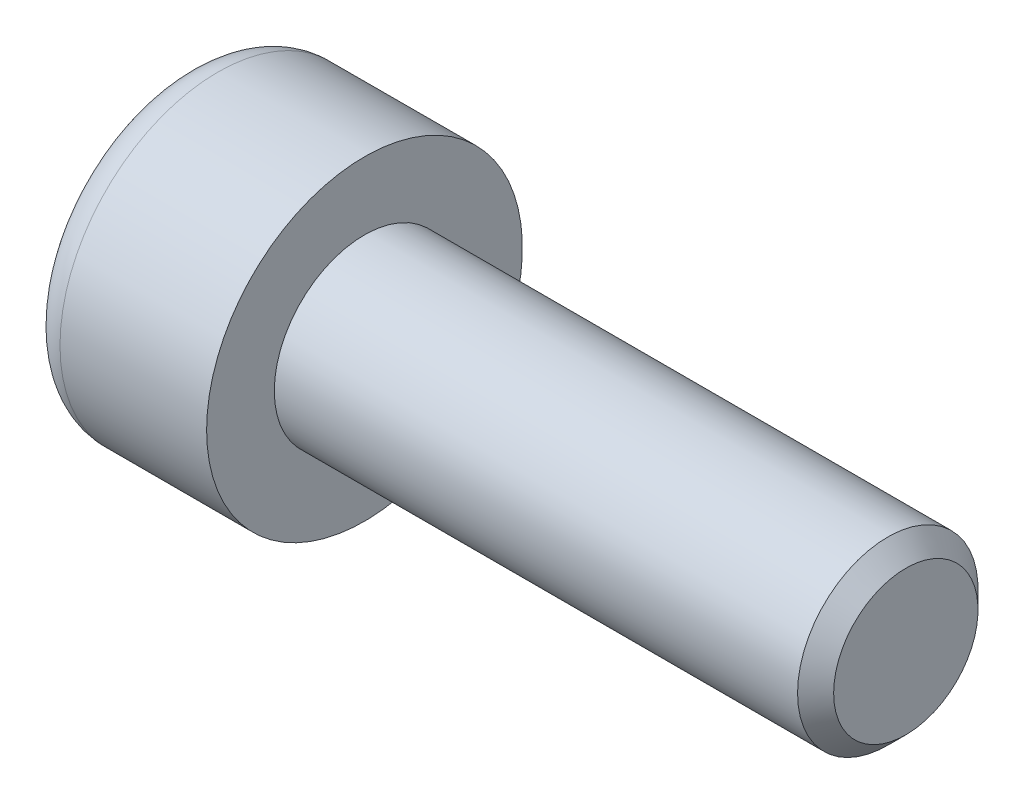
ISO-10303-21;
HEADER;
FILE_DESCRIPTION(('STEP AP214'),'2;1');
FILE_NAME('part.step','',(''),(''),'','','');
FILE_SCHEMA(('AUTOMOTIVE_DESIGN { 1 0 10303 214 1 1 1 1 }'));
ENDSEC;
DATA;
#1=APPLICATION_CONTEXT('core data for automotive mechanical design processes');
#2=APPLICATION_PROTOCOL_DEFINITION('international standard','automotive_design',2000,#1);
#3=PRODUCT_CONTEXT('',#1,'mechanical');
#4=PRODUCT('Part','Part','',(#3));
#5=PRODUCT_RELATED_PRODUCT_CATEGORY('part','',(#4));
#6=PRODUCT_DEFINITION_FORMATION('','',#4);
#7=PRODUCT_DEFINITION_CONTEXT('part definition',#1,'design');
#8=PRODUCT_DEFINITION('design','',#6,#7);
#9=PRODUCT_DEFINITION_SHAPE('','',#8);
#10=(LENGTH_UNIT() NAMED_UNIT(*) SI_UNIT(.MILLI.,.METRE.));
#11=(NAMED_UNIT(*) PLANE_ANGLE_UNIT() SI_UNIT($,.RADIAN.));
#12=(NAMED_UNIT(*) SI_UNIT($,.STERADIAN.) SOLID_ANGLE_UNIT());
#13=UNCERTAINTY_MEASURE_WITH_UNIT(LENGTH_MEASURE(1.E-05),#10,'distance_accuracy_value','');
#14=(GEOMETRIC_REPRESENTATION_CONTEXT(3) GLOBAL_UNCERTAINTY_ASSIGNED_CONTEXT((#13)) GLOBAL_UNIT_ASSIGNED_CONTEXT((#10,
#11,#12)) REPRESENTATION_CONTEXT('',''));
#15=CARTESIAN_POINT('',(0.,0.,0.));
#16=DIRECTION('',(0.,0.,1.));
#17=DIRECTION('',(1.,0.,0.));
#18=AXIS2_PLACEMENT_3D('',#15,#16,#17);
#19=CARTESIAN_POINT('',(12.,2.,0.));
#20=DIRECTION('',(-1.,0.,0.));
#21=DIRECTION('',(0.,0.,1.));
#22=AXIS2_PLACEMENT_3D('',#19,#20,#21);
#23=PLANE('',#22);
#24=CARTESIAN_POINT('',(12.,0.,0.));
#25=DIRECTION('',(-1.,0.,0.));
#26=DIRECTION('',(0.,0.,1.));
#27=AXIS2_PLACEMENT_3D('',#24,#25,#26);
#28=CIRCLE('',#27,1.59999999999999);
#29=CARTESIAN_POINT('',(12.,0.,1.59999999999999));
#30=VERTEX_POINT('',#29);
#31=EDGE_CURVE('E149',#30,#30,#28,.F.);
#32=ORIENTED_EDGE('',*,*,#31,.T.);
#33=EDGE_LOOP('',(#32));
#34=FACE_BOUND('',#33,.T.);
#35=ADVANCED_FACE('F32',(#34),#23,.F.);
#36=CARTESIAN_POINT('',(-28.9826848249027,0.,0.));
#37=DIRECTION('',(-1.,0.,0.));
#38=DIRECTION('',(0.,0.,1.));
#39=AXIS2_PLACEMENT_3D('',#36,#37,#38);
#40=CYLINDRICAL_SURFACE('',#39,2.);
#41=CARTESIAN_POINT('',(11.6,0.,0.));
#42=DIRECTION('',(-1.,0.,0.));
#43=DIRECTION('',(0.,0.,1.));
#44=AXIS2_PLACEMENT_3D('',#41,#42,#43);
#45=CIRCLE('',#44,2.);
#46=CARTESIAN_POINT('',(11.6,0.,2.));
#47=VERTEX_POINT('',#46);
#48=EDGE_CURVE('E146',#47,#47,#45,.T.);
#49=ORIENTED_EDGE('',*,*,#48,.T.);
#50=EDGE_LOOP('',(#49));
#51=FACE_BOUND('',#50,.T.);
#52=CARTESIAN_POINT('',(0.,0.,0.));
#53=DIRECTION('',(-1.,0.,0.));
#54=DIRECTION('',(0.,0.,1.));
#55=AXIS2_PLACEMENT_3D('',#52,#53,#54);
#56=CIRCLE('',#55,2.);
#57=CARTESIAN_POINT('',(0.,0.,2.));
#58=VERTEX_POINT('',#57);
#59=EDGE_CURVE('E143',#58,#58,#56,.T.);
#60=ORIENTED_EDGE('',*,*,#59,.F.);
#61=EDGE_LOOP('',(#60));
#62=FACE_BOUND('',#61,.T.);
#63=ADVANCED_FACE('F170',(#51,#62),#40,.T.);
#64=CARTESIAN_POINT('',(0.,3.5,0.));
#65=DIRECTION('',(-1.,0.,0.));
#66=DIRECTION('',(0.,0.,1.));
#67=AXIS2_PLACEMENT_3D('',#64,#65,#66);
#68=PLANE('',#67);
#69=CARTESIAN_POINT('',(0.,0.,0.));
#70=DIRECTION('',(-1.,0.,0.));
#71=DIRECTION('',(0.,0.,1.));
#72=AXIS2_PLACEMENT_3D('',#69,#70,#71);
#73=CIRCLE('',#72,3.5);
#74=CARTESIAN_POINT('',(0.,0.,3.5));
#75=VERTEX_POINT('',#74);
#76=EDGE_CURVE('E134',#75,#75,#73,.T.);
#77=ORIENTED_EDGE('',*,*,#76,.F.);
#78=EDGE_LOOP('',(#77));
#79=FACE_BOUND('',#78,.T.);
#80=ORIENTED_EDGE('',*,*,#59,.T.);
#81=EDGE_LOOP('',(#80));
#82=FACE_BOUND('',#81,.T.);
#83=ADVANCED_FACE('F175',(#79,#82),#68,.F.);
#84=CARTESIAN_POINT('',(-28.9826848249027,0.,0.));
#85=DIRECTION('',(-1.,0.,0.));
#86=DIRECTION('',(0.,0.,1.));
#87=AXIS2_PLACEMENT_3D('',#84,#85,#86);
#88=CYLINDRICAL_SURFACE('',#87,3.5);
#89=CARTESIAN_POINT('',(-3.25,0.,0.));
#90=DIRECTION('',(1.,0.,0.));
#91=DIRECTION('',(0.,0.,-1.));
#92=AXIS2_PLACEMENT_3D('',#89,#90,#91);
#93=CIRCLE('',#92,3.5);
#94=CARTESIAN_POINT('',(-3.25,0.,-3.5));
#95=VERTEX_POINT('',#94);
#96=EDGE_CURVE('E11',#95,#95,#93,.T.);
#97=ORIENTED_EDGE('',*,*,#96,.T.);
#98=EDGE_LOOP('',(#97));
#99=FACE_BOUND('',#98,.T.);
#100=ORIENTED_EDGE('',*,*,#76,.T.);
#101=EDGE_LOOP('',(#100));
#102=FACE_BOUND('',#101,.T.);
#103=ADVANCED_FACE('F184',(#99,#102),#88,.T.);
#104=CARTESIAN_POINT('',(-4.,0.,0.));
#105=DIRECTION('',(1.,0.,0.));
#106=DIRECTION('',(0.,0.,-1.));
#107=AXIS2_PLACEMENT_3D('',#104,#105,#106);
#108=PLANE('',#107);
#109=DIRECTION('',(0.,0.86602540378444,-0.499999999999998));
#110=VECTOR('',#109,1.);
#111=CARTESIAN_POINT('',(-4.,1.5,0.866025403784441));
#112=LINE('',#111,#110);
#113=CARTESIAN_POINT('',(-4.,0.,1.73205080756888));
#114=VERTEX_POINT('',#113);
#115=CARTESIAN_POINT('',(-4.,1.5,0.866025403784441));
#116=VERTEX_POINT('',#115);
#117=EDGE_CURVE('E100',#114,#116,#112,.T.);
#118=ORIENTED_EDGE('',*,*,#117,.F.);
#119=DIRECTION('',(0.,0.86602540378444,0.499999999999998));
#120=VECTOR('',#119,1.);
#121=CARTESIAN_POINT('',(-4.,0.,1.73205080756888));
#122=LINE('',#121,#120);
#123=CARTESIAN_POINT('',(-4.,-1.5,0.866025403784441));
#124=VERTEX_POINT('',#123);
#125=EDGE_CURVE('E46',#124,#114,#122,.T.);
#126=ORIENTED_EDGE('',*,*,#125,.F.);
#127=DIRECTION('',(0.,0.,1.));
#128=VECTOR('',#127,1.);
#129=CARTESIAN_POINT('',(-4.,-1.5,0.866025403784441));
#130=LINE('',#129,#128);
#131=CARTESIAN_POINT('',(-4.,-1.5,-0.86602540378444));
#132=VERTEX_POINT('',#131);
#133=EDGE_CURVE('E116',#132,#124,#130,.T.);
#134=ORIENTED_EDGE('',*,*,#133,.F.);
#135=DIRECTION('',(0.,-0.86602540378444,0.499999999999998));
#136=VECTOR('',#135,1.);
#137=CARTESIAN_POINT('',(-4.,-1.5,-0.86602540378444));
#138=LINE('',#137,#136);
#139=CARTESIAN_POINT('',(-4.,0.,-1.73205080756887));
#140=VERTEX_POINT('',#139);
#141=EDGE_CURVE('E110',#140,#132,#138,.T.);
#142=ORIENTED_EDGE('',*,*,#141,.F.);
#143=DIRECTION('',(0.,-0.86602540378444,-0.499999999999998));
#144=VECTOR('',#143,1.);
#145=CARTESIAN_POINT('',(-4.,0.,-1.73205080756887));
#146=LINE('',#145,#144);
#147=CARTESIAN_POINT('',(-4.,1.5,-0.866025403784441));
#148=VERTEX_POINT('',#147);
#149=EDGE_CURVE('E108',#148,#140,#146,.T.);
#150=ORIENTED_EDGE('',*,*,#149,.F.);
#151=DIRECTION('',(0.,0.,-1.));
#152=VECTOR('',#151,1.);
#153=CARTESIAN_POINT('',(-4.,1.5,-0.866025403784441));
#154=LINE('',#153,#152);
#155=EDGE_CURVE('E89',#116,#148,#154,.T.);
#156=ORIENTED_EDGE('',*,*,#155,.F.);
#157=EDGE_LOOP('',(#118,#126,#134,#142,#150,#156));
#158=FACE_BOUND('',#157,.T.);
#159=CARTESIAN_POINT('',(-4.,0.,0.));
#160=DIRECTION('',(1.,0.,0.));
#161=DIRECTION('',(0.,0.,-1.));
#162=AXIS2_PLACEMENT_3D('',#159,#160,#161);
#163=CIRCLE('',#162,2.75);
#164=CARTESIAN_POINT('',(-4.,0.,-2.75));
#165=VERTEX_POINT('',#164);
#166=EDGE_CURVE('E39',#165,#165,#163,.F.);
#167=ORIENTED_EDGE('',*,*,#166,.T.);
#168=EDGE_LOOP('',(#167));
#169=FACE_BOUND('',#168,.T.);
#170=ADVANCED_FACE('F104',(#158,#169),#108,.F.);
#171=CARTESIAN_POINT('',(11.6,0.,0.));
#172=DIRECTION('',(-1.,0.,0.));
#173=DIRECTION('',(0.,0.,1.));
#174=AXIS2_PLACEMENT_3D('',#171,#172,#173);
#175=CONICAL_SURFACE('',#174,2.,0.785398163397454);
#176=ORIENTED_EDGE('',*,*,#31,.F.);
#177=EDGE_LOOP('',(#176));
#178=FACE_BOUND('',#177,.T.);
#179=ORIENTED_EDGE('',*,*,#48,.F.);
#180=EDGE_LOOP('',(#179));
#181=FACE_BOUND('',#180,.T.);
#182=ADVANCED_FACE('F157',(#178,#181),#175,.T.);
#183=CARTESIAN_POINT('',(-3.25,0.,0.));
#184=DIRECTION('',(1.,0.,0.));
#185=DIRECTION('',(0.,0.,-1.));
#186=AXIS2_PLACEMENT_3D('',#183,#184,#185);
#187=TOROIDAL_SURFACE('',#186,2.75,0.75);
#188=ORIENTED_EDGE('',*,*,#96,.F.);
#189=EDGE_LOOP('',(#188));
#190=FACE_BOUND('',#189,.T.);
#191=ORIENTED_EDGE('',*,*,#166,.F.);
#192=EDGE_LOOP('',(#191));
#193=FACE_BOUND('',#192,.T.);
#194=ADVANCED_FACE('F154',(#190,#193),#187,.T.);
#195=CARTESIAN_POINT('',(-1.5,0.,1.73205080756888));
#196=DIRECTION('',(0.,-0.499999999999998,0.86602540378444));
#197=DIRECTION('',(0.,-0.86602540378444,-0.499999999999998));
#198=AXIS2_PLACEMENT_3D('',#195,#196,#197);
#199=PLANE('',#198);
#200=ORIENTED_EDGE('',*,*,#125,.T.);
#201=DIRECTION('',(-1.,0.,0.));
#202=VECTOR('',#201,1.);
#203=CARTESIAN_POINT('',(-1.5,0.,1.73205080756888));
#204=LINE('',#203,#202);
#205=CARTESIAN_POINT('',(-1.5,0.,1.73205080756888));
#206=VERTEX_POINT('',#205);
#207=EDGE_CURVE('E97',#206,#114,#204,.T.);
#208=ORIENTED_EDGE('',*,*,#207,.F.);
#209=DIRECTION('',(0.,0.86602540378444,0.499999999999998));
#210=VECTOR('',#209,1.);
#211=CARTESIAN_POINT('',(-1.5,0.,1.73205080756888));
#212=LINE('',#211,#210);
#213=CARTESIAN_POINT('',(-1.5,-1.5,0.866025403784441));
#214=VERTEX_POINT('',#213);
#215=EDGE_CURVE('E118',#214,#206,#212,.T.);
#216=ORIENTED_EDGE('',*,*,#215,.F.);
#217=DIRECTION('',(-1.,0.,0.));
#218=VECTOR('',#217,1.);
#219=CARTESIAN_POINT('',(-1.5,-1.5,0.866025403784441));
#220=LINE('',#219,#218);
#221=EDGE_CURVE('E53',#214,#124,#220,.T.);
#222=ORIENTED_EDGE('',*,*,#221,.T.);
#223=EDGE_LOOP('',(#200,#208,#216,#222));
#224=FACE_BOUND('',#223,.T.);
#225=ADVANCED_FACE('F156',(#224),#199,.F.);
#226=CARTESIAN_POINT('',(-1.5,-1.5,0.866025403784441));
#227=DIRECTION('',(0.,-1.,0.));
#228=DIRECTION('',(0.,0.,-1.));
#229=AXIS2_PLACEMENT_3D('',#226,#227,#228);
#230=PLANE('',#229);
#231=ORIENTED_EDGE('',*,*,#133,.T.);
#232=ORIENTED_EDGE('',*,*,#221,.F.);
#233=DIRECTION('',(0.,0.,1.));
#234=VECTOR('',#233,1.);
#235=CARTESIAN_POINT('',(-1.5,-1.5,0.866025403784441));
#236=LINE('',#235,#234);
#237=CARTESIAN_POINT('',(-1.5,-1.5,-0.86602540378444));
#238=VERTEX_POINT('',#237);
#239=EDGE_CURVE('E130',#238,#214,#236,.T.);
#240=ORIENTED_EDGE('',*,*,#239,.F.);
#241=DIRECTION('',(-1.,0.,0.));
#242=VECTOR('',#241,1.);
#243=CARTESIAN_POINT('',(-1.5,-1.5,-0.86602540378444));
#244=LINE('',#243,#242);
#245=EDGE_CURVE('E135',#238,#132,#244,.T.);
#246=ORIENTED_EDGE('',*,*,#245,.T.);
#247=EDGE_LOOP('',(#231,#232,#240,#246));
#248=FACE_BOUND('',#247,.T.);
#249=ADVANCED_FACE('F164',(#248),#230,.F.);
#250=CARTESIAN_POINT('',(-1.5,-1.5,-0.86602540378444));
#251=DIRECTION('',(0.,-0.499999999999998,-0.86602540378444));
#252=DIRECTION('',(0.,0.86602540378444,-0.499999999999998));
#253=AXIS2_PLACEMENT_3D('',#250,#251,#252);
#254=PLANE('',#253);
#255=ORIENTED_EDGE('',*,*,#141,.T.);
#256=ORIENTED_EDGE('',*,*,#245,.F.);
#257=DIRECTION('',(0.,-0.86602540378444,0.499999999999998));
#258=VECTOR('',#257,1.);
#259=CARTESIAN_POINT('',(-1.5,-1.5,-0.86602540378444));
#260=LINE('',#259,#258);
#261=CARTESIAN_POINT('',(-1.5,0.,-1.73205080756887));
#262=VERTEX_POINT('',#261);
#263=EDGE_CURVE('E127',#262,#238,#260,.T.);
#264=ORIENTED_EDGE('',*,*,#263,.F.);
#265=DIRECTION('',(-1.,0.,0.));
#266=VECTOR('',#265,1.);
#267=CARTESIAN_POINT('',(-1.5,0.,-1.73205080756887));
#268=LINE('',#267,#266);
#269=EDGE_CURVE('E137',#262,#140,#268,.T.);
#270=ORIENTED_EDGE('',*,*,#269,.T.);
#271=EDGE_LOOP('',(#255,#256,#264,#270));
#272=FACE_BOUND('',#271,.T.);
#273=ADVANCED_FACE('F230',(#272),#254,.F.);
#274=CARTESIAN_POINT('',(-1.5,0.,-1.73205080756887));
#275=DIRECTION('',(0.,0.499999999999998,-0.86602540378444));
#276=DIRECTION('',(0.,0.86602540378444,0.499999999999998));
#277=AXIS2_PLACEMENT_3D('',#274,#275,#276);
#278=PLANE('',#277);
#279=ORIENTED_EDGE('',*,*,#149,.T.);
#280=ORIENTED_EDGE('',*,*,#269,.F.);
#281=DIRECTION('',(0.,-0.86602540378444,-0.499999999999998));
#282=VECTOR('',#281,1.);
#283=CARTESIAN_POINT('',(-1.5,0.,-1.73205080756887));
#284=LINE('',#283,#282);
#285=CARTESIAN_POINT('',(-1.5,1.5,-0.866025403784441));
#286=VERTEX_POINT('',#285);
#287=EDGE_CURVE('E124',#286,#262,#284,.T.);
#288=ORIENTED_EDGE('',*,*,#287,.F.);
#289=DIRECTION('',(-1.,0.,0.));
#290=VECTOR('',#289,1.);
#291=CARTESIAN_POINT('',(-1.5,1.5,-0.866025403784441));
#292=LINE('',#291,#290);
#293=EDGE_CURVE('E96',#286,#148,#292,.T.);
#294=ORIENTED_EDGE('',*,*,#293,.T.);
#295=EDGE_LOOP('',(#279,#280,#288,#294));
#296=FACE_BOUND('',#295,.T.);
#297=ADVANCED_FACE('F238',(#296),#278,.F.);
#298=CARTESIAN_POINT('',(-1.5,1.5,-0.866025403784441));
#299=DIRECTION('',(0.,1.,0.));
#300=DIRECTION('',(0.,0.,1.));
#301=AXIS2_PLACEMENT_3D('',#298,#299,#300);
#302=PLANE('',#301);
#303=ORIENTED_EDGE('',*,*,#155,.T.);
#304=ORIENTED_EDGE('',*,*,#293,.F.);
#305=DIRECTION('',(0.,0.,-1.));
#306=VECTOR('',#305,1.);
#307=CARTESIAN_POINT('',(-1.5,1.5,-0.866025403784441));
#308=LINE('',#307,#306);
#309=CARTESIAN_POINT('',(-1.5,1.5,0.866025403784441));
#310=VERTEX_POINT('',#309);
#311=EDGE_CURVE('E92',#310,#286,#308,.T.);
#312=ORIENTED_EDGE('',*,*,#311,.F.);
#313=DIRECTION('',(-1.,0.,0.));
#314=VECTOR('',#313,1.);
#315=CARTESIAN_POINT('',(-1.5,1.5,0.866025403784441));
#316=LINE('',#315,#314);
#317=EDGE_CURVE('E85',#310,#116,#316,.T.);
#318=ORIENTED_EDGE('',*,*,#317,.T.);
#319=EDGE_LOOP('',(#303,#304,#312,#318));
#320=FACE_BOUND('',#319,.T.);
#321=ADVANCED_FACE('F87',(#320),#302,.F.);
#322=CARTESIAN_POINT('',(-1.5,1.5,0.866025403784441));
#323=DIRECTION('',(0.,0.499999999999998,0.86602540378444));
#324=DIRECTION('',(0.,-0.86602540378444,0.499999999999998));
#325=AXIS2_PLACEMENT_3D('',#322,#323,#324);
#326=PLANE('',#325);
#327=ORIENTED_EDGE('',*,*,#117,.T.);
#328=ORIENTED_EDGE('',*,*,#317,.F.);
#329=DIRECTION('',(0.,0.86602540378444,-0.499999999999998));
#330=VECTOR('',#329,1.);
#331=CARTESIAN_POINT('',(-1.5,1.5,0.866025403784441));
#332=LINE('',#331,#330);
#333=EDGE_CURVE('E121',#206,#310,#332,.T.);
#334=ORIENTED_EDGE('',*,*,#333,.F.);
#335=ORIENTED_EDGE('',*,*,#207,.T.);
#336=EDGE_LOOP('',(#327,#328,#334,#335));
#337=FACE_BOUND('',#336,.T.);
#338=ADVANCED_FACE('F101',(#337),#326,.F.);
#339=CARTESIAN_POINT('',(-1.5,-1.5,0.866025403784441));
#340=DIRECTION('',(1.,0.,0.));
#341=DIRECTION('',(0.,0.,-1.));
#342=AXIS2_PLACEMENT_3D('',#339,#340,#341);
#343=PLANE('',#342);
#344=ORIENTED_EDGE('',*,*,#215,.T.);
#345=ORIENTED_EDGE('',*,*,#333,.T.);
#346=ORIENTED_EDGE('',*,*,#311,.T.);
#347=ORIENTED_EDGE('',*,*,#287,.T.);
#348=ORIENTED_EDGE('',*,*,#263,.T.);
#349=ORIENTED_EDGE('',*,*,#239,.T.);
#350=EDGE_LOOP('',(#344,#345,#346,#347,#348,#349));
#351=FACE_BOUND('',#350,.T.);
#352=ADVANCED_FACE('F262',(#351),#343,.F.);
#353=CLOSED_SHELL('',(#35,#63,#83,#103,#170,#182,#194,#225,#249,#273,#297,#321,#338,#352));
#354=MANIFOLD_SOLID_BREP('B2',#353);
#355=ADVANCED_BREP_SHAPE_REPRESENTATION('',(#18,#354),#14);
#356=SHAPE_DEFINITION_REPRESENTATION(#9,#355);
ENDSEC;
END-ISO-10303-21;
